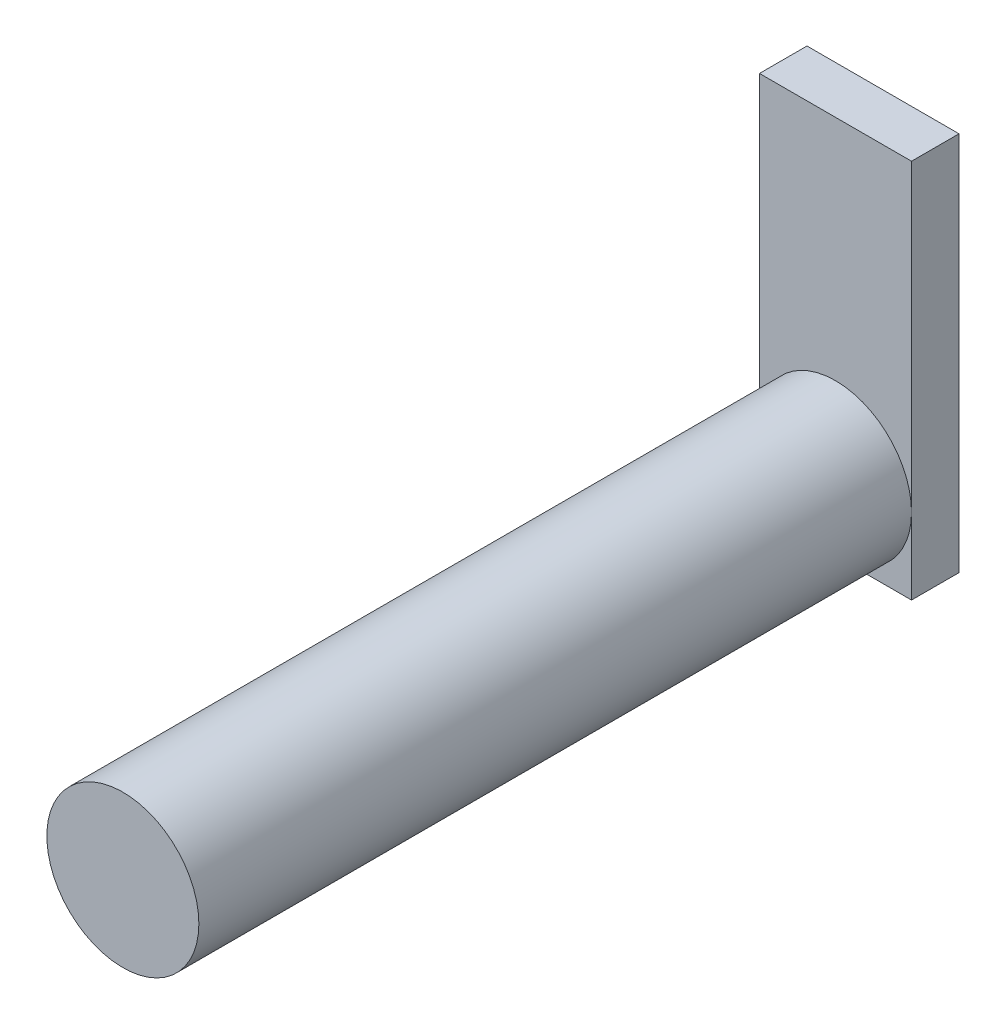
ISO-10303-21;
HEADER;
FILE_DESCRIPTION(('STEP AP214'),'2;1');
FILE_NAME('part.step','',(''),(''),'','','');
FILE_SCHEMA(('AUTOMOTIVE_DESIGN { 1 0 10303 214 1 1 1 1 }'));
ENDSEC;
DATA;
#1=APPLICATION_CONTEXT('core data for automotive mechanical design processes');
#2=APPLICATION_PROTOCOL_DEFINITION('international standard','automotive_design',2000,#1);
#3=PRODUCT_CONTEXT('',#1,'mechanical');
#4=PRODUCT('Part','Part','',(#3));
#5=PRODUCT_RELATED_PRODUCT_CATEGORY('part','',(#4));
#6=PRODUCT_DEFINITION_FORMATION('','',#4);
#7=PRODUCT_DEFINITION_CONTEXT('part definition',#1,'design');
#8=PRODUCT_DEFINITION('design','',#6,#7);
#9=PRODUCT_DEFINITION_SHAPE('','',#8);
#10=(LENGTH_UNIT() NAMED_UNIT(*) SI_UNIT(.MILLI.,.METRE.));
#11=(NAMED_UNIT(*) PLANE_ANGLE_UNIT() SI_UNIT($,.RADIAN.));
#12=(NAMED_UNIT(*) SI_UNIT($,.STERADIAN.) SOLID_ANGLE_UNIT());
#13=UNCERTAINTY_MEASURE_WITH_UNIT(LENGTH_MEASURE(1.E-05),#10,'distance_accuracy_value','');
#14=(GEOMETRIC_REPRESENTATION_CONTEXT(3) GLOBAL_UNCERTAINTY_ASSIGNED_CONTEXT((#13)) GLOBAL_UNIT_ASSIGNED_CONTEXT((#10,
#11,#12)) REPRESENTATION_CONTEXT('',''));
#15=CARTESIAN_POINT('',(0.,0.,0.));
#16=DIRECTION('',(0.,0.,1.));
#17=DIRECTION('',(1.,0.,0.));
#18=AXIS2_PLACEMENT_3D('',#15,#16,#17);
#19=CARTESIAN_POINT('',(0.,0.,150.));
#20=DIRECTION('',(0.,0.,-1.));
#21=DIRECTION('',(-1.,0.,0.));
#22=AXIS2_PLACEMENT_3D('',#19,#20,#21);
#23=CYLINDRICAL_SURFACE('',#22,16.);
#24=CARTESIAN_POINT('',(0.,0.,150.));
#25=DIRECTION('',(0.,0.,1.));
#26=DIRECTION('',(1.,0.,0.));
#27=AXIS2_PLACEMENT_3D('',#24,#25,#26);
#28=CIRCLE('',#27,16.);
#29=CARTESIAN_POINT('',(16.,0.,150.));
#30=VERTEX_POINT('',#29);
#31=EDGE_CURVE('E11',#30,#30,#28,.T.);
#32=ORIENTED_EDGE('',*,*,#31,.F.);
#33=EDGE_LOOP('',(#32));
#34=FACE_BOUND('',#33,.T.);
#35=CARTESIAN_POINT('',(0.,0.,0.));
#36=DIRECTION('',(0.,0.,1.));
#37=DIRECTION('',(1.,0.,0.));
#38=AXIS2_PLACEMENT_3D('',#35,#36,#37);
#39=CIRCLE('',#38,16.);
#40=CARTESIAN_POINT('',(16.,0.,0.));
#41=VERTEX_POINT('',#40);
#42=CARTESIAN_POINT('',(-16.,0.,0.));
#43=VERTEX_POINT('',#42);
#44=EDGE_CURVE('E35',#41,#43,#39,.T.);
#45=ORIENTED_EDGE('',*,*,#44,.T.);
#46=CARTESIAN_POINT('',(0.,-16.,0.));
#47=VERTEX_POINT('',#46);
#48=EDGE_CURVE('E106',#43,#47,#39,.T.);
#49=ORIENTED_EDGE('',*,*,#48,.T.);
#50=EDGE_CURVE('E53',#47,#41,#39,.T.);
#51=ORIENTED_EDGE('',*,*,#50,.T.);
#52=EDGE_LOOP('',(#45,#49,#51));
#53=FACE_BOUND('',#52,.T.);
#54=ADVANCED_FACE('F32',(#34,#53),#23,.T.);
#55=CARTESIAN_POINT('',(0.,0.,150.));
#56=DIRECTION('',(0.,0.,1.));
#57=DIRECTION('',(1.,0.,0.));
#58=AXIS2_PLACEMENT_3D('',#55,#56,#57);
#59=PLANE('',#58);
#60=ORIENTED_EDGE('',*,*,#31,.T.);
#61=EDGE_LOOP('',(#60));
#62=FACE_BOUND('',#61,.T.);
#63=ADVANCED_FACE('F151',(#62),#59,.T.);
#64=CARTESIAN_POINT('',(16.,64.,0.));
#65=DIRECTION('',(0.,0.,1.));
#66=DIRECTION('',(1.,0.,0.));
#67=AXIS2_PLACEMENT_3D('',#64,#65,#66);
#68=PLANE('',#67);
#69=ORIENTED_EDGE('',*,*,#44,.F.);
#70=DIRECTION('',(0.,-1.,0.));
#71=VECTOR('',#70,1.);
#72=CARTESIAN_POINT('',(16.,-16.,0.));
#73=LINE('',#72,#71);
#74=CARTESIAN_POINT('',(16.,64.,0.));
#75=VERTEX_POINT('',#74);
#76=EDGE_CURVE('E46',#75,#41,#73,.T.);
#77=ORIENTED_EDGE('',*,*,#76,.F.);
#78=DIRECTION('',(1.,0.,0.));
#79=VECTOR('',#78,1.);
#80=CARTESIAN_POINT('',(16.,64.,0.));
#81=LINE('',#80,#79);
#82=CARTESIAN_POINT('',(-16.,64.,0.));
#83=VERTEX_POINT('',#82);
#84=EDGE_CURVE('E101',#83,#75,#81,.T.);
#85=ORIENTED_EDGE('',*,*,#84,.F.);
#86=DIRECTION('',(0.,1.,0.));
#87=VECTOR('',#86,1.);
#88=CARTESIAN_POINT('',(-16.,-16.,0.));
#89=LINE('',#88,#87);
#90=EDGE_CURVE('E118',#43,#83,#89,.T.);
#91=ORIENTED_EDGE('',*,*,#90,.F.);
#92=EDGE_LOOP('',(#69,#77,#85,#91));
#93=FACE_BOUND('',#92,.T.);
#94=ADVANCED_FACE('F133',(#93),#68,.T.);
#95=ORIENTED_EDGE('',*,*,#48,.F.);
#96=CARTESIAN_POINT('',(-16.,-16.,0.));
#97=VERTEX_POINT('',#96);
#98=EDGE_CURVE('E115',#97,#43,#89,.T.);
#99=ORIENTED_EDGE('',*,*,#98,.F.);
#100=DIRECTION('',(-1.,0.,0.));
#101=VECTOR('',#100,1.);
#102=CARTESIAN_POINT('',(16.,-16.,0.));
#103=LINE('',#102,#101);
#104=EDGE_CURVE('E121',#47,#97,#103,.T.);
#105=ORIENTED_EDGE('',*,*,#104,.F.);
#106=EDGE_LOOP('',(#95,#99,#105));
#107=FACE_BOUND('',#106,.T.);
#108=ADVANCED_FACE('F139',(#107),#68,.T.);
#109=ORIENTED_EDGE('',*,*,#50,.F.);
#110=CARTESIAN_POINT('',(16.,-16.,0.));
#111=VERTEX_POINT('',#110);
#112=EDGE_CURVE('E119',#111,#47,#103,.T.);
#113=ORIENTED_EDGE('',*,*,#112,.F.);
#114=EDGE_CURVE('E104',#41,#111,#73,.T.);
#115=ORIENTED_EDGE('',*,*,#114,.F.);
#116=EDGE_LOOP('',(#109,#113,#115));
#117=FACE_BOUND('',#116,.T.);
#118=ADVANCED_FACE('F140',(#117),#68,.T.);
#119=CARTESIAN_POINT('',(16.,-16.,-10.));
#120=DIRECTION('',(-1.,0.,0.));
#121=DIRECTION('',(0.,0.,1.));
#122=AXIS2_PLACEMENT_3D('',#119,#120,#121);
#123=PLANE('',#122);
#124=ORIENTED_EDGE('',*,*,#76,.T.);
#125=ORIENTED_EDGE('',*,*,#114,.T.);
#126=DIRECTION('',(0.,0.,1.));
#127=VECTOR('',#126,1.);
#128=CARTESIAN_POINT('',(16.,-16.,-10.));
#129=LINE('',#128,#127);
#130=CARTESIAN_POINT('',(16.,-16.,-10.));
#131=VERTEX_POINT('',#130);
#132=EDGE_CURVE('E88',#131,#111,#129,.T.);
#133=ORIENTED_EDGE('',*,*,#132,.F.);
#134=DIRECTION('',(0.,-1.,0.));
#135=VECTOR('',#134,1.);
#136=CARTESIAN_POINT('',(16.,-16.,-10.));
#137=LINE('',#136,#135);
#138=CARTESIAN_POINT('',(16.,64.,-10.));
#139=VERTEX_POINT('',#138);
#140=EDGE_CURVE('E94',#139,#131,#137,.T.);
#141=ORIENTED_EDGE('',*,*,#140,.F.);
#142=DIRECTION('',(0.,0.,1.));
#143=VECTOR('',#142,1.);
#144=CARTESIAN_POINT('',(16.,64.,-10.));
#145=LINE('',#144,#143);
#146=EDGE_CURVE('E112',#139,#75,#145,.T.);
#147=ORIENTED_EDGE('',*,*,#146,.T.);
#148=EDGE_LOOP('',(#124,#125,#133,#141,#147));
#149=FACE_BOUND('',#148,.T.);
#150=ADVANCED_FACE('F103',(#149),#123,.F.);
#151=CARTESIAN_POINT('',(16.,-16.,-10.));
#152=DIRECTION('',(0.,1.,0.));
#153=DIRECTION('',(0.,0.,1.));
#154=AXIS2_PLACEMENT_3D('',#151,#152,#153);
#155=PLANE('',#154);
#156=ORIENTED_EDGE('',*,*,#112,.T.);
#157=ORIENTED_EDGE('',*,*,#104,.T.);
#158=DIRECTION('',(0.,0.,1.));
#159=VECTOR('',#158,1.);
#160=CARTESIAN_POINT('',(-16.,-16.,-10.));
#161=LINE('',#160,#159);
#162=CARTESIAN_POINT('',(-16.,-16.,-10.));
#163=VERTEX_POINT('',#162);
#164=EDGE_CURVE('E90',#163,#97,#161,.T.);
#165=ORIENTED_EDGE('',*,*,#164,.F.);
#166=DIRECTION('',(-1.,0.,0.));
#167=VECTOR('',#166,1.);
#168=CARTESIAN_POINT('',(16.,-16.,-10.));
#169=LINE('',#168,#167);
#170=EDGE_CURVE('E83',#131,#163,#169,.T.);
#171=ORIENTED_EDGE('',*,*,#170,.F.);
#172=ORIENTED_EDGE('',*,*,#132,.T.);
#173=EDGE_LOOP('',(#156,#157,#165,#171,#172));
#174=FACE_BOUND('',#173,.T.);
#175=ADVANCED_FACE('F86',(#174),#155,.F.);
#176=CARTESIAN_POINT('',(-16.,-16.,-10.));
#177=DIRECTION('',(1.,0.,0.));
#178=DIRECTION('',(0.,1.,0.));
#179=AXIS2_PLACEMENT_3D('',#176,#177,#178);
#180=PLANE('',#179);
#181=ORIENTED_EDGE('',*,*,#98,.T.);
#182=ORIENTED_EDGE('',*,*,#90,.T.);
#183=DIRECTION('',(0.,0.,1.));
#184=VECTOR('',#183,1.);
#185=CARTESIAN_POINT('',(-16.,64.,-10.));
#186=LINE('',#185,#184);
#187=CARTESIAN_POINT('',(-16.,64.,-10.));
#188=VERTEX_POINT('',#187);
#189=EDGE_CURVE('E107',#188,#83,#186,.T.);
#190=ORIENTED_EDGE('',*,*,#189,.F.);
#191=DIRECTION('',(0.,1.,0.));
#192=VECTOR('',#191,1.);
#193=CARTESIAN_POINT('',(-16.,-16.,-10.));
#194=LINE('',#193,#192);
#195=EDGE_CURVE('E93',#163,#188,#194,.T.);
#196=ORIENTED_EDGE('',*,*,#195,.F.);
#197=ORIENTED_EDGE('',*,*,#164,.T.);
#198=EDGE_LOOP('',(#181,#182,#190,#196,#197));
#199=FACE_BOUND('',#198,.T.);
#200=ADVANCED_FACE('F126',(#199),#180,.F.);
#201=CARTESIAN_POINT('',(16.,64.,-10.));
#202=DIRECTION('',(0.,-1.,0.));
#203=DIRECTION('',(0.,0.,-1.));
#204=AXIS2_PLACEMENT_3D('',#201,#202,#203);
#205=PLANE('',#204);
#206=ORIENTED_EDGE('',*,*,#84,.T.);
#207=ORIENTED_EDGE('',*,*,#146,.F.);
#208=DIRECTION('',(1.,0.,0.));
#209=VECTOR('',#208,1.);
#210=CARTESIAN_POINT('',(16.,64.,-10.));
#211=LINE('',#210,#209);
#212=EDGE_CURVE('E99',#188,#139,#211,.T.);
#213=ORIENTED_EDGE('',*,*,#212,.F.);
#214=ORIENTED_EDGE('',*,*,#189,.T.);
#215=EDGE_LOOP('',(#206,#207,#213,#214));
#216=FACE_BOUND('',#215,.T.);
#217=ADVANCED_FACE('F130',(#216),#205,.F.);
#218=CARTESIAN_POINT('',(16.,64.,-10.));
#219=DIRECTION('',(0.,0.,1.));
#220=DIRECTION('',(1.,0.,0.));
#221=AXIS2_PLACEMENT_3D('',#218,#219,#220);
#222=PLANE('',#221);
#223=ORIENTED_EDGE('',*,*,#140,.T.);
#224=ORIENTED_EDGE('',*,*,#170,.T.);
#225=ORIENTED_EDGE('',*,*,#195,.T.);
#226=ORIENTED_EDGE('',*,*,#212,.T.);
#227=EDGE_LOOP('',(#223,#224,#225,#226));
#228=FACE_BOUND('',#227,.T.);
#229=ADVANCED_FACE('F97',(#228),#222,.F.);
#230=CLOSED_SHELL('',(#54,#63,#94,#108,#118,#150,#175,#200,#217,#229));
#231=MANIFOLD_SOLID_BREP('B2',#230);
#232=ADVANCED_BREP_SHAPE_REPRESENTATION('',(#18,#231),#14);
#233=SHAPE_DEFINITION_REPRESENTATION(#9,#232);
ENDSEC;
END-ISO-10303-21;
